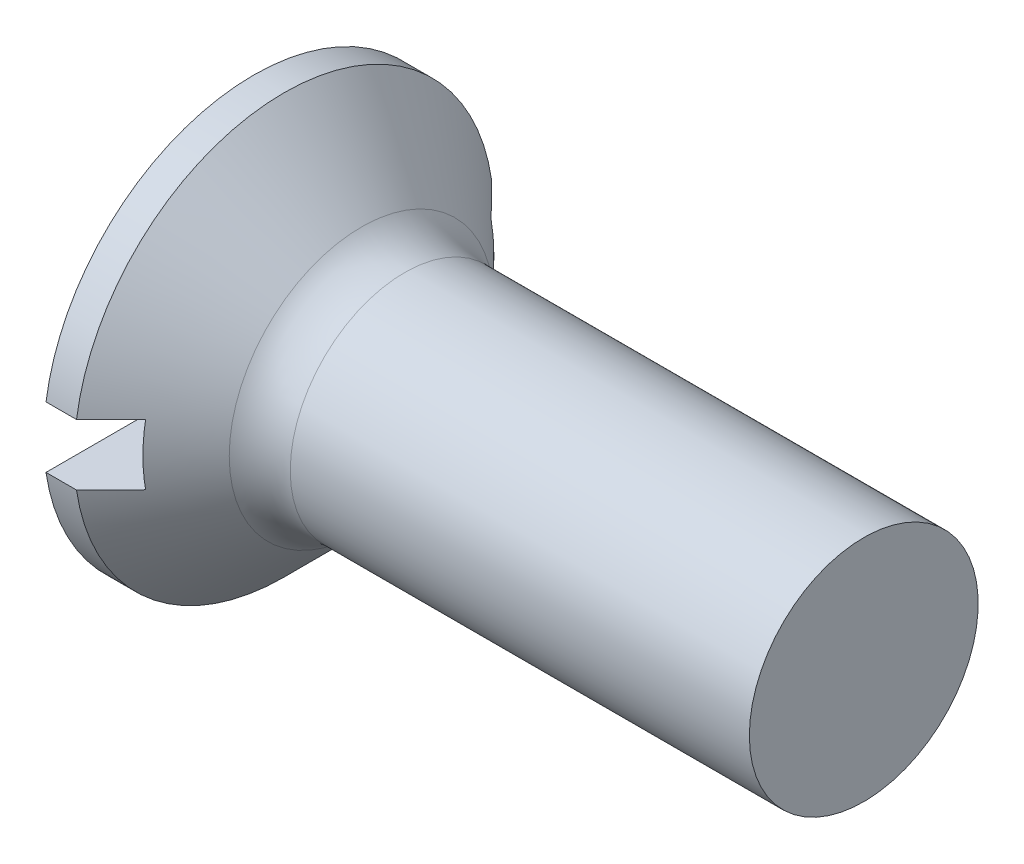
from build123d import *

# Parameters (mm, degrees)
FILLET1_R  = 0.8
SKETCH2_W  = 5.5
SKETCH2_H  = 0.8
SLOT_DEPTH = 0.85


with BuildPart() as part:
    # BodySke → Base-Revolve (revolve)
    with BuildSketch(Plane.XY, mode=Mode.PRIVATE) as base_revolve_sk:
        Polygon((0, 0), (0, 2.75), (0.4, 2.75), (1.65, 1.5), (8, 1.5), (8, 0), align=None)
    revolve(base_revolve_sk.sketch.rotate(Axis((-6.35, 0, 0), (1, 0, 0)), 90), axis=Axis((-6.35, 0, 0), (1, 0, 0)))

    # Fillet1
    fillet1_edges = [part.edges().sort_by_distance(p)[0] for p in [
        (1.65, 0, -1.5),
    ]]
    fillet(fillet1_edges, radius=FILLET1_R)

    # Sketch2 → Slot (cut)
    with BuildSketch(Plane.ZY):
        Rectangle(SKETCH2_W, SKETCH2_H)
    extrude(amount=-SLOT_DEPTH, mode=Mode.SUBTRACT)


solid = part.part
